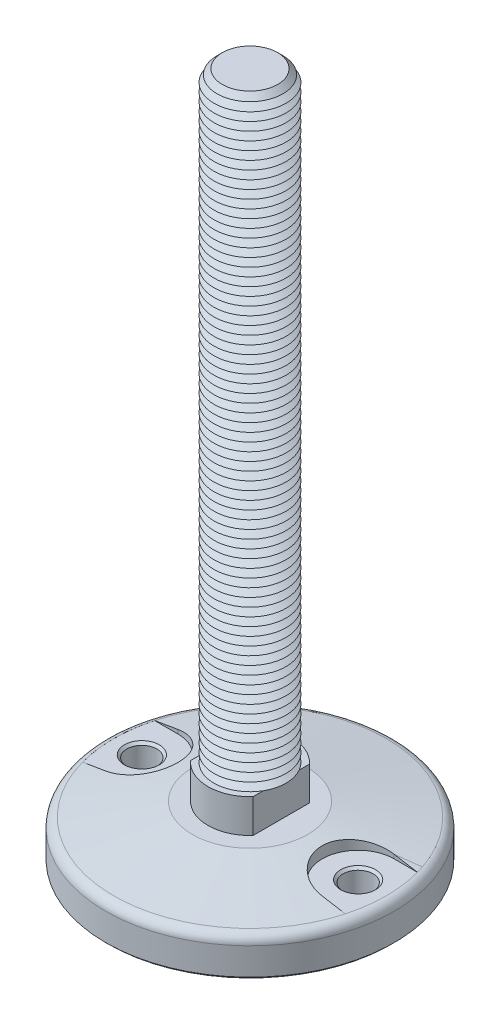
from build123d import *

# Parameters (mm, degrees)
FILLET1_R                = 4
SKETCH3_R                = 17.5
BOSS_EXTRUDE1_DEPTH      = 14
CUT_EXTRUDE1_START       = -14
CUT_EXTRUDE1_DEPTH       = 14
SKETCH5_R                = 15
BOSS_EXTRUDE2_DEPTH      = 250
CHAMFER1_SIZE            = 3.5
LPATTERN1_COUNT          = 71
LPATTERN1_PITCH          = 3.5
CUT_EXTRUDE4_DEPTH       = 5.79
SKETCH10_R               = 6.25
CUT_EXTRUDE5_DEPTH       = 16.21
CHAMFER2_SIZE            = 1
CHAMFER2_OF_MIRROR1_SIZE = 1
CHAMFER3_SIZE            = 1


with BuildPart() as part:
    # Sketch2 → Revolve1 (revolve)
    with BuildSketch(Plane(origin=(0, 0, 0), x_dir=(0, 0, -1), z_dir=(1, 0, 0))):
        Polygon((0, 0), (-24, 0), (-60, -6.347771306), (-60, -22), (0, -22), align=None)
    revolve(axis=Axis((0, 61.338865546, 0), (0, -1, 0)))

    # Fillet1
    fillet1_edges = [part.edges().sort_by_distance(p)[0] for p in [
        (0, -6.347771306, -60),
    ]]
    fillet(fillet1_edges, radius=FILLET1_R)

    # Sketch3 → Boss-Extrude1 (add)
    with BuildSketch(Plane(origin=(0, 0, 0), x_dir=(1, 0, 0), z_dir=(0, 1, 0))):
        with Locations(Location((0, 0, 0), (0, 0, 270))):
            Circle(SKETCH3_R)
    extrude(amount=BOSS_EXTRUDE1_DEPTH)

    # Sketch4 → Cut-Extrude1 (cut)
    with BuildSketch(Plane(origin=(0, 14, 0), x_dir=(1, 0, 0), z_dir=(0, 1, 0)).offset(CUT_EXTRUDE1_START)):
        with BuildLine():
            Line((-13, 11.715374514), (-13, -11.715374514))
            ThreePointArc((-13, -11.715374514), (-17.5, 0), (-13, 11.715374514))
        make_face()
        with BuildLine():
            Line((13, -11.715374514), (13, 11.715374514))
            ThreePointArc((13, 11.715374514), (17.5, 0), (13, -11.715374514))
        make_face()
    extrude(amount=CUT_EXTRUDE1_DEPTH, mode=Mode.SUBTRACT)

    # Sketch5 → Boss-Extrude2 (add)
    with BuildSketch(Plane(origin=(0, 14, 0), x_dir=(1, 0, 0), z_dir=(0, 1, 0))):
        with Locations(Location((0, 0, 0), (0, 0, 29.926434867))):
            Circle(SKETCH5_R)
    extrude(amount=BOSS_EXTRUDE2_DEPTH)

    # Chamfer1
    chamfer1_edges = [part.edges().sort_by_distance(p)[0] for p in [
        (-13, 264, 7.483314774),
    ]]
    chamfer(chamfer1_edges, length=CHAMFER1_SIZE)

    # Sketch6 → Cut-Revolve1 (revolve, cut)
    with BuildSketch(Plane(origin=(0, 0, 0), x_dir=(0, 0, -1), z_dir=(1, 0, 0)), mode=Mode.PRIVATE) as cut_revolve1_sk:
        Polygon((-15, 14), (-11.968911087, 15.75), (-15, 17.5), align=None)
    cut_revolve1 = revolve(cut_revolve1_sk.sketch.rotate(Axis((0, 61.338865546, 0), (0, -1, 0)), 240.073565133), axis=Axis((0, 61.338865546, 0), (0, -1, 0)), mode=Mode.SUBTRACT)

    # LPattern1: Cut-Revolve1 ×71
    with Locations(*[(0, i * LPATTERN1_PITCH, 0) for i in range(1, LPATTERN1_COUNT)]):
        add(cut_revolve1, mode=Mode.SUBTRACT)

    # Sketch8 → Cut-Extrude4 (cut)
    with BuildSketch(Plane(origin=(0, 0, 0), x_dir=(1, 0, 0), z_dir=(0, 1, 0))):
        with BuildLine():
            Line((-45, 15), (-54.674279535, 15))
            ThreePointArc((-54.674279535, 15), (-56.694592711, 0), (-54.674279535, -15))
            Line((-54.674279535, -15), (-45, -15))
            ThreePointArc((-45, -15), (-30, 0), (-45, 15))
        make_face()
    cut_extrude4 = extrude(amount=-CUT_EXTRUDE4_DEPTH, mode=Mode.SUBTRACT)

    # Sketch10 → Cut-Extrude5 (cut)
    with BuildSketch(Plane(origin=(0, -5.79, 0), x_dir=(1, 0, 0), z_dir=(0, 1, 0))):
        with Locations(Location((-45, 0, 0), (0, 0, 270))):
            Circle(SKETCH10_R)
    cut_extrude5 = extrude(amount=-CUT_EXTRUDE5_DEPTH, mode=Mode.SUBTRACT)

    # Chamfer2
    chamfer2_edges = [part.edges().sort_by_distance(p)[0] for p in [
        (-45, -5.79, -6.25),
        (-45, -22, -6.25),
    ]]
    chamfer(chamfer2_edges, length=CHAMFER2_SIZE)

    # Mirror1: Cut-Extrude4, Cut-Extrude5 across plane
    add(cut_extrude4.mirror(Plane(origin=(0, 0, 0), x_dir=(0, 0, 1), z_dir=(1, 0, 0))), mode=Mode.SUBTRACT)
    add(cut_extrude5.mirror(Plane(origin=(0, 0, 0), x_dir=(0, 0, 1), z_dir=(1, 0, 0))), mode=Mode.SUBTRACT)

    # Chamfer2 of Mirror1
    chamfer2_of_mirror1_edges = [part.edges().sort_by_distance(p)[0] for p in [
        (45, -5.79, -6.25),
        (45, -22, -6.25),
    ]]
    chamfer(chamfer2_of_mirror1_edges, length=CHAMFER2_OF_MIRROR1_SIZE)

    # Chamfer3
    chamfer3_edges = [part.edges().sort_by_distance(p)[0] for p in [
        (0, -22, -60),
    ]]
    chamfer(chamfer3_edges, length=CHAMFER3_SIZE)


solid = part.part
